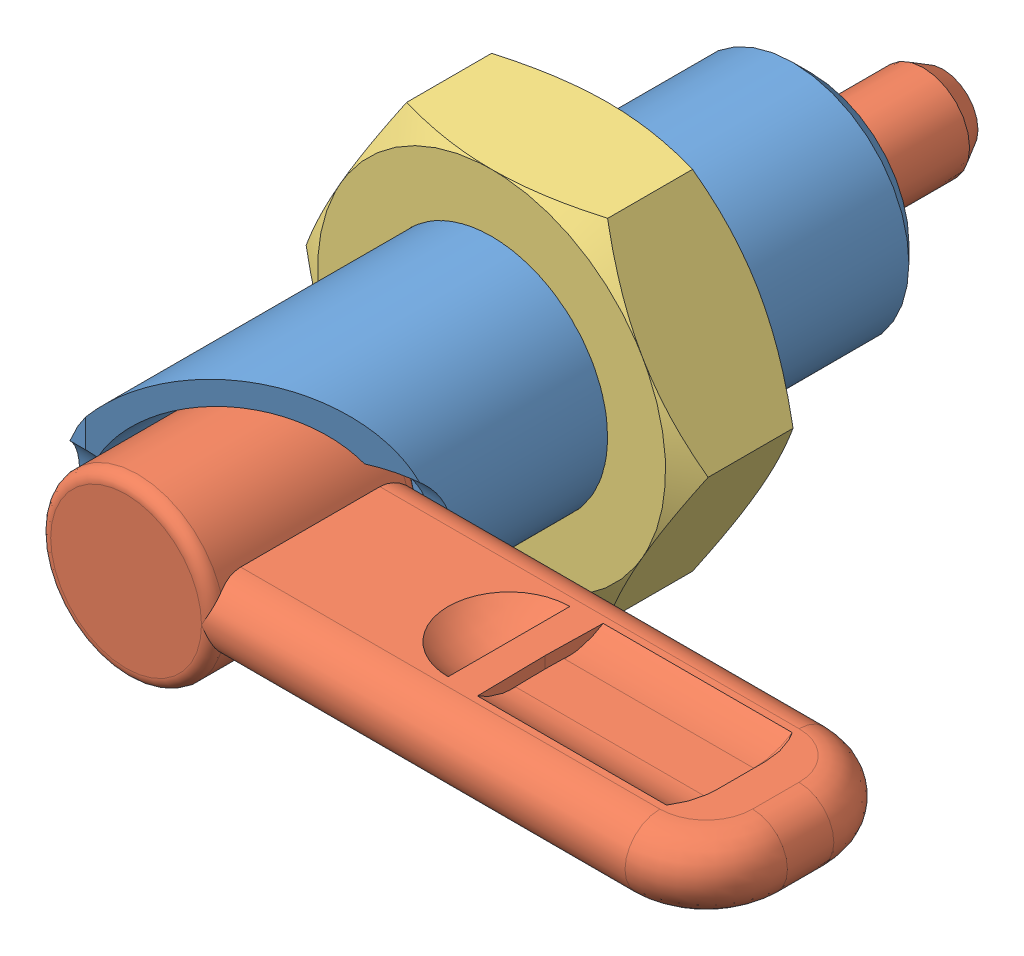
SolidWorks assembly GDX20LW-8N-SUS.sldasm, configuration Default (file format 15000). Lengths in mm.
Overall size (70.5 40.99 71).
3 component instances, 3 part files, 0 mates.
Components (placement in the parent):
- GDX20LW-8N-SUS_01-1: GDX20LW-8N-SUS_01.SLDPRT [ﾃﾞﾌｫﾙﾄ] x (1 0 0) z (0 -1 0) size (20.02 57.18 20.01)
- GDX20LW-8N-SUS_02-1: GDX20LW-8N-SUS_02.SLDPRT [ﾃﾞﾌｫﾙﾄ] x (1 0 0) z (0 -1 0) size (57.5 71 15)
- GDX20LW-8N-SUS_03-1: GDX20LW-8N-SUS_03.SLDPRT [ﾃﾞﾌｫﾙﾄ] at (0 0 17.5) x (0 0 1) z (0 1 0) size (10.01 40.99 40.99)
